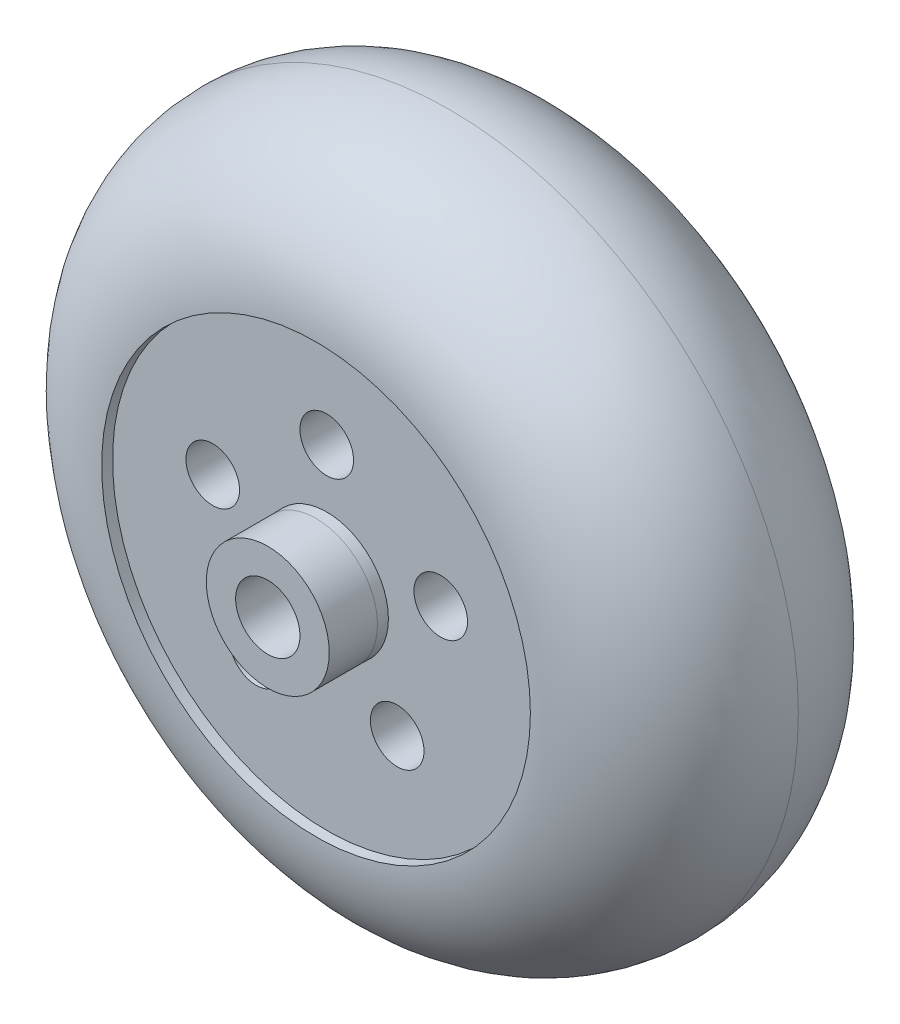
ISO-10303-21;
HEADER;
FILE_DESCRIPTION(('STEP AP214'),'2;1');
FILE_NAME('part.step','',(''),(''),'','','');
FILE_SCHEMA(('AUTOMOTIVE_DESIGN { 1 0 10303 214 1 1 1 1 }'));
ENDSEC;
DATA;
#1=APPLICATION_CONTEXT('core data for automotive mechanical design processes');
#2=APPLICATION_PROTOCOL_DEFINITION('international standard','automotive_design',2000,#1);
#3=PRODUCT_CONTEXT('',#1,'mechanical');
#4=PRODUCT('Part','Part','',(#3));
#5=PRODUCT_RELATED_PRODUCT_CATEGORY('part','',(#4));
#6=PRODUCT_DEFINITION_FORMATION('','',#4);
#7=PRODUCT_DEFINITION_CONTEXT('part definition',#1,'design');
#8=PRODUCT_DEFINITION('design','',#6,#7);
#9=PRODUCT_DEFINITION_SHAPE('','',#8);
#10=(LENGTH_UNIT() NAMED_UNIT(*) SI_UNIT(.MILLI.,.METRE.));
#11=(NAMED_UNIT(*) PLANE_ANGLE_UNIT() SI_UNIT($,.RADIAN.));
#12=(NAMED_UNIT(*) SI_UNIT($,.STERADIAN.) SOLID_ANGLE_UNIT());
#13=UNCERTAINTY_MEASURE_WITH_UNIT(LENGTH_MEASURE(1.E-05),#10,'distance_accuracy_value','');
#14=(GEOMETRIC_REPRESENTATION_CONTEXT(3) GLOBAL_UNCERTAINTY_ASSIGNED_CONTEXT((#13)) GLOBAL_UNIT_ASSIGNED_CONTEXT((#10,
#11,#12)) REPRESENTATION_CONTEXT('',''));
#15=CARTESIAN_POINT('',(0.,0.,0.));
#16=DIRECTION('',(0.,0.,1.));
#17=DIRECTION('',(1.,0.,0.));
#18=AXIS2_PLACEMENT_3D('',#15,#16,#17);
#19=CARTESIAN_POINT('',(0.,11.1823834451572,0.));
#20=DIRECTION('',(0.,0.,1.));
#21=DIRECTION('',(1.,0.,0.));
#22=AXIS2_PLACEMENT_3D('',#19,#20,#21);
#23=CYLINDRICAL_SURFACE('',#22,2.5);
#24=CARTESIAN_POINT('',(0.,11.1823834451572,24.));
#25=DIRECTION('',(0.,0.,1.));
#26=DIRECTION('',(1.,0.,0.));
#27=AXIS2_PLACEMENT_3D('',#24,#25,#26);
#28=CIRCLE('',#27,2.5);
#29=CARTESIAN_POINT('',(2.5,11.1823834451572,24.));
#30=VERTEX_POINT('',#29);
#31=EDGE_CURVE('E57',#30,#30,#28,.T.);
#32=ORIENTED_EDGE('',*,*,#31,.T.);
#33=EDGE_LOOP('',(#32));
#34=FACE_BOUND('',#33,.T.);
#35=CARTESIAN_POINT('',(0.,11.1823834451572,1.));
#36=DIRECTION('',(0.,0.,-1.));
#37=DIRECTION('',(-1.,0.,0.));
#38=AXIS2_PLACEMENT_3D('',#35,#36,#37);
#39=CIRCLE('',#38,2.5);
#40=CARTESIAN_POINT('',(-2.5,11.1823834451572,1.));
#41=VERTEX_POINT('',#40);
#42=EDGE_CURVE('E72',#41,#41,#39,.F.);
#43=ORIENTED_EDGE('',*,*,#42,.F.);
#44=EDGE_LOOP('',(#43));
#45=FACE_BOUND('',#44,.T.);
#46=ADVANCED_FACE('F34',(#34,#45),#23,.F.);
#47=CARTESIAN_POINT('',(10.6350786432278,3.45554652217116,0.));
#48=DIRECTION('',(0.,0.,1.));
#49=DIRECTION('',(1.,0.,0.));
#50=AXIS2_PLACEMENT_3D('',#47,#48,#49);
#51=CYLINDRICAL_SURFACE('',#50,2.50000000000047);
#52=CARTESIAN_POINT('',(10.6350786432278,3.45554652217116,24.));
#53=DIRECTION('',(0.,0.,1.));
#54=DIRECTION('',(1.,0.,0.));
#55=AXIS2_PLACEMENT_3D('',#52,#53,#54);
#56=CIRCLE('',#55,2.50000000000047);
#57=CARTESIAN_POINT('',(13.1350786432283,3.45554652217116,24.));
#58=VERTEX_POINT('',#57);
#59=EDGE_CURVE('E60',#58,#58,#56,.T.);
#60=ORIENTED_EDGE('',*,*,#59,.T.);
#61=EDGE_LOOP('',(#60));
#62=FACE_BOUND('',#61,.T.);
#63=CARTESIAN_POINT('',(10.6350786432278,3.45554652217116,1.));
#64=DIRECTION('',(0.,0.,-1.));
#65=DIRECTION('',(-1.,0.,0.));
#66=AXIS2_PLACEMENT_3D('',#63,#64,#65);
#67=CIRCLE('',#66,2.50000000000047);
#68=CARTESIAN_POINT('',(8.13507864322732,3.45554652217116,1.));
#69=VERTEX_POINT('',#68);
#70=EDGE_CURVE('E75',#69,#69,#67,.F.);
#71=ORIENTED_EDGE('',*,*,#70,.F.);
#72=EDGE_LOOP('',(#71));
#73=FACE_BOUND('',#72,.T.);
#74=ADVANCED_FACE('F121',(#62,#73),#51,.F.);
#75=CARTESIAN_POINT('',(6.57284007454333,-9.04673824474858,0.));
#76=DIRECTION('',(0.,0.,1.));
#77=DIRECTION('',(1.,0.,0.));
#78=AXIS2_PLACEMENT_3D('',#75,#76,#77);
#79=CYLINDRICAL_SURFACE('',#78,2.50000000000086);
#80=CARTESIAN_POINT('',(6.57284007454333,-9.04673824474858,24.));
#81=DIRECTION('',(0.,0.,1.));
#82=DIRECTION('',(1.,0.,0.));
#83=AXIS2_PLACEMENT_3D('',#80,#81,#82);
#84=CIRCLE('',#83,2.50000000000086);
#85=CARTESIAN_POINT('',(9.07284007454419,-9.04673824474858,24.));
#86=VERTEX_POINT('',#85);
#87=EDGE_CURVE('E63',#86,#86,#84,.T.);
#88=ORIENTED_EDGE('',*,*,#87,.T.);
#89=EDGE_LOOP('',(#88));
#90=FACE_BOUND('',#89,.T.);
#91=CARTESIAN_POINT('',(6.57284007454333,-9.04673824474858,1.));
#92=DIRECTION('',(0.,0.,-1.));
#93=DIRECTION('',(-1.,0.,0.));
#94=AXIS2_PLACEMENT_3D('',#91,#92,#93);
#95=CIRCLE('',#94,2.50000000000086);
#96=CARTESIAN_POINT('',(4.07284007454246,-9.04673824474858,1.));
#97=VERTEX_POINT('',#96);
#98=EDGE_CURVE('E78',#97,#97,#95,.F.);
#99=ORIENTED_EDGE('',*,*,#98,.F.);
#100=EDGE_LOOP('',(#99));
#101=FACE_BOUND('',#100,.T.);
#102=ADVANCED_FACE('F127',(#90,#101),#79,.F.);
#103=CARTESIAN_POINT('',(-6.57284007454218,-9.04673824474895,0.));
#104=DIRECTION('',(0.,0.,1.));
#105=DIRECTION('',(1.,0.,0.));
#106=AXIS2_PLACEMENT_3D('',#103,#104,#105);
#107=CYLINDRICAL_SURFACE('',#106,2.50000000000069);
#108=CARTESIAN_POINT('',(-6.57284007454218,-9.04673824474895,24.));
#109=DIRECTION('',(0.,0.,1.));
#110=DIRECTION('',(1.,0.,0.));
#111=AXIS2_PLACEMENT_3D('',#108,#109,#110);
#112=CIRCLE('',#111,2.50000000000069);
#113=CARTESIAN_POINT('',(-4.0728400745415,-9.04673824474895,24.));
#114=VERTEX_POINT('',#113);
#115=EDGE_CURVE('E66',#114,#114,#112,.T.);
#116=ORIENTED_EDGE('',*,*,#115,.T.);
#117=EDGE_LOOP('',(#116));
#118=FACE_BOUND('',#117,.T.);
#119=CARTESIAN_POINT('',(-6.57284007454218,-9.04673824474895,1.));
#120=DIRECTION('',(0.,0.,-1.));
#121=DIRECTION('',(-1.,0.,0.));
#122=AXIS2_PLACEMENT_3D('',#119,#120,#121);
#123=CIRCLE('',#122,2.50000000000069);
#124=CARTESIAN_POINT('',(-9.07284007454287,-9.04673824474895,1.));
#125=VERTEX_POINT('',#124);
#126=EDGE_CURVE('E81',#125,#125,#123,.F.);
#127=ORIENTED_EDGE('',*,*,#126,.F.);
#128=EDGE_LOOP('',(#127));
#129=FACE_BOUND('',#128,.T.);
#130=ADVANCED_FACE('F157',(#118,#129),#107,.F.);
#131=CARTESIAN_POINT('',(-10.6350786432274,3.45554652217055,0.));
#132=DIRECTION('',(0.,0.,1.));
#133=DIRECTION('',(1.,0.,0.));
#134=AXIS2_PLACEMENT_3D('',#131,#132,#133);
#135=CYLINDRICAL_SURFACE('',#134,2.50000000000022);
#136=CARTESIAN_POINT('',(-10.6350786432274,3.45554652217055,24.));
#137=DIRECTION('',(0.,0.,1.));
#138=DIRECTION('',(1.,0.,0.));
#139=AXIS2_PLACEMENT_3D('',#136,#137,#138);
#140=CIRCLE('',#139,2.50000000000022);
#141=CARTESIAN_POINT('',(-8.13507864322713,3.45554652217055,24.));
#142=VERTEX_POINT('',#141);
#143=EDGE_CURVE('E69',#142,#142,#140,.T.);
#144=ORIENTED_EDGE('',*,*,#143,.T.);
#145=EDGE_LOOP('',(#144));
#146=FACE_BOUND('',#145,.T.);
#147=CARTESIAN_POINT('',(-10.6350786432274,3.45554652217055,1.));
#148=DIRECTION('',(0.,0.,-1.));
#149=DIRECTION('',(-1.,0.,0.));
#150=AXIS2_PLACEMENT_3D('',#147,#148,#149);
#151=CIRCLE('',#150,2.50000000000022);
#152=CARTESIAN_POINT('',(-13.1350786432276,3.45554652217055,1.));
#153=VERTEX_POINT('',#152);
#154=EDGE_CURVE('E38',#153,#153,#151,.F.);
#155=ORIENTED_EDGE('',*,*,#154,.F.);
#156=EDGE_LOOP('',(#155));
#157=FACE_BOUND('',#156,.T.);
#158=ADVANCED_FACE('F150',(#146,#157),#135,.F.);
#159=CARTESIAN_POINT('',(0.,0.,12.5));
#160=DIRECTION('',(0.,0.,1.));
#161=DIRECTION('',(1.,0.,0.));
#162=AXIS2_PLACEMENT_3D('',#159,#160,#161);
#163=TOROIDAL_SURFACE('',#162,20.,12.5);
#164=CARTESIAN_POINT('',(0.,0.,12.5));
#165=DIRECTION('',(0.,0.,1.));
#166=DIRECTION('',(1.,0.,0.));
#167=AXIS2_PLACEMENT_3D('',#164,#165,#166);
#168=CIRCLE('',#167,32.5);
#169=CARTESIAN_POINT('',(32.5,0.,12.5));
#170=VERTEX_POINT('',#169);
#171=EDGE_CURVE('E10',#170,#170,#168,.F.);
#172=ORIENTED_EDGE('',*,*,#171,.F.);
#173=EDGE_LOOP('',(#172));
#174=FACE_BOUND('',#173,.T.);
#175=CARTESIAN_POINT('',(0.,0.,25.));
#176=DIRECTION('',(0.,0.,1.));
#177=DIRECTION('',(1.,0.,0.));
#178=AXIS2_PLACEMENT_3D('',#175,#176,#177);
#179=CIRCLE('',#178,20.);
#180=CARTESIAN_POINT('',(20.,0.,25.));
#181=VERTEX_POINT('',#180);
#182=EDGE_CURVE('E46',#181,#181,#179,.T.);
#183=ORIENTED_EDGE('',*,*,#182,.F.);
#184=EDGE_LOOP('',(#183));
#185=FACE_BOUND('',#184,.T.);
#186=ADVANCED_FACE('F148',(#174,#185),#163,.T.);
#187=CARTESIAN_POINT('',(0.,0.,12.5));
#188=DIRECTION('',(0.,0.,1.));
#189=DIRECTION('',(1.,0.,0.));
#190=AXIS2_PLACEMENT_3D('',#187,#188,#189);
#191=TOROIDAL_SURFACE('',#190,20.,12.5);
#192=CARTESIAN_POINT('',(0.,0.,0.));
#193=DIRECTION('',(0.,0.,-1.));
#194=DIRECTION('',(-1.,0.,0.));
#195=AXIS2_PLACEMENT_3D('',#192,#193,#194);
#196=CIRCLE('',#195,20.);
#197=CARTESIAN_POINT('',(-20.,0.,0.));
#198=VERTEX_POINT('',#197);
#199=EDGE_CURVE('E84',#198,#198,#196,.T.);
#200=ORIENTED_EDGE('',*,*,#199,.F.);
#201=EDGE_LOOP('',(#200));
#202=FACE_BOUND('',#201,.T.);
#203=ORIENTED_EDGE('',*,*,#171,.T.);
#204=EDGE_LOOP('',(#203));
#205=FACE_BOUND('',#204,.T.);
#206=ADVANCED_FACE('F36',(#202,#205),#191,.T.);
#207=CARTESIAN_POINT('',(0.,0.,0.));
#208=DIRECTION('',(0.,0.,1.));
#209=DIRECTION('',(1.,0.,0.));
#210=AXIS2_PLACEMENT_3D('',#207,#208,#209);
#211=CYLINDRICAL_SURFACE('',#210,3.);
#212=CARTESIAN_POINT('',(0.,0.,29.5));
#213=DIRECTION('',(0.,0.,1.));
#214=DIRECTION('',(1.,0.,0.));
#215=AXIS2_PLACEMENT_3D('',#212,#213,#214);
#216=CIRCLE('',#215,3.);
#217=CARTESIAN_POINT('',(3.,0.,29.5));
#218=VERTEX_POINT('',#217);
#219=EDGE_CURVE('E96',#218,#218,#216,.T.);
#220=ORIENTED_EDGE('',*,*,#219,.T.);
#221=EDGE_LOOP('',(#220));
#222=FACE_BOUND('',#221,.T.);
#223=CARTESIAN_POINT('',(0.,0.,-4.5));
#224=DIRECTION('',(0.,0.,-1.));
#225=DIRECTION('',(-1.,0.,0.));
#226=AXIS2_PLACEMENT_3D('',#223,#224,#225);
#227=CIRCLE('',#226,3.);
#228=CARTESIAN_POINT('',(-3.,0.,-4.5));
#229=VERTEX_POINT('',#228);
#230=EDGE_CURVE('E102',#229,#229,#227,.T.);
#231=ORIENTED_EDGE('',*,*,#230,.T.);
#232=EDGE_LOOP('',(#231));
#233=FACE_BOUND('',#232,.T.);
#234=ADVANCED_FACE('F106',(#222,#233),#211,.F.);
#235=CARTESIAN_POINT('',(0.,0.,25.));
#236=DIRECTION('',(0.,0.,1.));
#237=DIRECTION('',(1.,0.,0.));
#238=AXIS2_PLACEMENT_3D('',#235,#236,#237);
#239=CONICAL_SURFACE('',#238,20.,0.0174532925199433);
#240=CARTESIAN_POINT('',(0.,0.,24.));
#241=DIRECTION('',(0.,0.,1.));
#242=DIRECTION('',(1.,0.,0.));
#243=AXIS2_PLACEMENT_3D('',#240,#241,#242);
#244=CIRCLE('',#243,19.9825449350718);
#245=CARTESIAN_POINT('',(19.9825449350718,0.,24.));
#246=VERTEX_POINT('',#245);
#247=EDGE_CURVE('E42',#246,#246,#244,.T.);
#248=ORIENTED_EDGE('',*,*,#247,.F.);
#249=EDGE_LOOP('',(#248));
#250=FACE_BOUND('',#249,.T.);
#251=ORIENTED_EDGE('',*,*,#182,.T.);
#252=EDGE_LOOP('',(#251));
#253=FACE_BOUND('',#252,.T.);
#254=ADVANCED_FACE('F137',(#250,#253),#239,.F.);
#255=CARTESIAN_POINT('',(0.,0.,24.));
#256=DIRECTION('',(0.,0.,1.));
#257=DIRECTION('',(1.,0.,0.));
#258=AXIS2_PLACEMENT_3D('',#255,#256,#257);
#259=PLANE('',#258);
#260=ORIENTED_EDGE('',*,*,#143,.F.);
#261=EDGE_LOOP('',(#260));
#262=FACE_BOUND('',#261,.T.);
#263=ORIENTED_EDGE('',*,*,#115,.F.);
#264=EDGE_LOOP('',(#263));
#265=FACE_BOUND('',#264,.T.);
#266=ORIENTED_EDGE('',*,*,#87,.F.);
#267=EDGE_LOOP('',(#266));
#268=FACE_BOUND('',#267,.T.);
#269=ORIENTED_EDGE('',*,*,#59,.F.);
#270=EDGE_LOOP('',(#269));
#271=FACE_BOUND('',#270,.T.);
#272=ORIENTED_EDGE('',*,*,#31,.F.);
#273=EDGE_LOOP('',(#272));
#274=FACE_BOUND('',#273,.T.);
#275=CARTESIAN_POINT('',(0.,0.,24.));
#276=DIRECTION('',(0.,0.,1.));
#277=DIRECTION('',(1.,0.,0.));
#278=AXIS2_PLACEMENT_3D('',#275,#276,#277);
#279=CIRCLE('',#278,5.75259580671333);
#280=CARTESIAN_POINT('',(5.75259580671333,0.,24.));
#281=VERTEX_POINT('',#280);
#282=EDGE_CURVE('E49',#281,#281,#279,.T.);
#283=ORIENTED_EDGE('',*,*,#282,.F.);
#284=EDGE_LOOP('',(#283));
#285=FACE_BOUND('',#284,.T.);
#286=ORIENTED_EDGE('',*,*,#247,.T.);
#287=EDGE_LOOP('',(#286));
#288=FACE_BOUND('',#287,.T.);
#289=ADVANCED_FACE('F133',(#262,#265,#268,#271,#274,#285,#288),#259,.T.);
#290=CARTESIAN_POINT('',(0.,0.,25.));
#291=DIRECTION('',(0.,0.,-1.));
#292=DIRECTION('',(1.,0.,0.));
#293=AXIS2_PLACEMENT_3D('',#290,#291,#292);
#294=CONICAL_SURFACE('',#293,5.73514074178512,0.0174532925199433);
#295=ORIENTED_EDGE('',*,*,#282,.T.);
#296=EDGE_LOOP('',(#295));
#297=FACE_BOUND('',#296,.T.);
#298=CARTESIAN_POINT('',(0.,0.,25.));
#299=DIRECTION('',(0.,0.,1.));
#300=DIRECTION('',(1.,0.,0.));
#301=AXIS2_PLACEMENT_3D('',#298,#299,#300);
#302=CIRCLE('',#301,5.73514074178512);
#303=CARTESIAN_POINT('',(5.73514074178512,0.,25.));
#304=VERTEX_POINT('',#303);
#305=EDGE_CURVE('E52',#304,#304,#302,.T.);
#306=ORIENTED_EDGE('',*,*,#305,.F.);
#307=EDGE_LOOP('',(#306));
#308=FACE_BOUND('',#307,.T.);
#309=ADVANCED_FACE('F136',(#297,#308),#294,.T.);
#310=CARTESIAN_POINT('',(0.,0.,1.));
#311=DIRECTION('',(0.,0.,-1.));
#312=DIRECTION('',(-1.,0.,0.));
#313=AXIS2_PLACEMENT_3D('',#310,#311,#312);
#314=PLANE('',#313);
#315=CARTESIAN_POINT('',(0.,0.,1.));
#316=DIRECTION('',(0.,0.,-1.));
#317=DIRECTION('',(-1.,0.,0.));
#318=AXIS2_PLACEMENT_3D('',#315,#316,#317);
#319=CIRCLE('',#318,6.);
#320=CARTESIAN_POINT('',(-6.,0.,1.));
#321=VERTEX_POINT('',#320);
#322=EDGE_CURVE('E88',#321,#321,#319,.T.);
#323=ORIENTED_EDGE('',*,*,#322,.F.);
#324=EDGE_LOOP('',(#323));
#325=FACE_BOUND('',#324,.T.);
#326=CARTESIAN_POINT('',(0.,0.,1.));
#327=DIRECTION('',(0.,0.,-1.));
#328=DIRECTION('',(-1.,0.,0.));
#329=AXIS2_PLACEMENT_3D('',#326,#327,#328);
#330=CIRCLE('',#329,20.);
#331=CARTESIAN_POINT('',(-20.,0.,1.));
#332=VERTEX_POINT('',#331);
#333=EDGE_CURVE('E87',#332,#332,#330,.T.);
#334=ORIENTED_EDGE('',*,*,#333,.T.);
#335=EDGE_LOOP('',(#334));
#336=FACE_BOUND('',#335,.T.);
#337=ORIENTED_EDGE('',*,*,#154,.T.);
#338=EDGE_LOOP('',(#337));
#339=FACE_BOUND('',#338,.T.);
#340=ORIENTED_EDGE('',*,*,#126,.T.);
#341=EDGE_LOOP('',(#340));
#342=FACE_BOUND('',#341,.T.);
#343=ORIENTED_EDGE('',*,*,#98,.T.);
#344=EDGE_LOOP('',(#343));
#345=FACE_BOUND('',#344,.T.);
#346=ORIENTED_EDGE('',*,*,#70,.T.);
#347=EDGE_LOOP('',(#346));
#348=FACE_BOUND('',#347,.T.);
#349=ORIENTED_EDGE('',*,*,#42,.T.);
#350=EDGE_LOOP('',(#349));
#351=FACE_BOUND('',#350,.T.);
#352=ADVANCED_FACE('F141',(#325,#336,#339,#342,#345,#348,#351),#314,.T.);
#353=CARTESIAN_POINT('',(0.,0.,1.));
#354=DIRECTION('',(0.,0.,-1.));
#355=DIRECTION('',(-1.,0.,0.));
#356=AXIS2_PLACEMENT_3D('',#353,#354,#355);
#357=CYLINDRICAL_SURFACE('',#356,20.);
#358=ORIENTED_EDGE('',*,*,#333,.F.);
#359=EDGE_LOOP('',(#358));
#360=FACE_BOUND('',#359,.T.);
#361=ORIENTED_EDGE('',*,*,#199,.T.);
#362=EDGE_LOOP('',(#361));
#363=FACE_BOUND('',#362,.T.);
#364=ADVANCED_FACE('F170',(#360,#363),#357,.F.);
#365=CARTESIAN_POINT('',(0.,0.,1.));
#366=DIRECTION('',(0.,0.,-1.));
#367=DIRECTION('',(-1.,0.,0.));
#368=AXIS2_PLACEMENT_3D('',#365,#366,#367);
#369=CYLINDRICAL_SURFACE('',#368,6.);
#370=ORIENTED_EDGE('',*,*,#322,.T.);
#371=EDGE_LOOP('',(#370));
#372=FACE_BOUND('',#371,.T.);
#373=CARTESIAN_POINT('',(0.,0.,-4.5));
#374=DIRECTION('',(0.,0.,-1.));
#375=DIRECTION('',(-1.,0.,0.));
#376=AXIS2_PLACEMENT_3D('',#373,#374,#375);
#377=CIRCLE('',#376,6.);
#378=CARTESIAN_POINT('',(-6.,0.,-4.5));
#379=VERTEX_POINT('',#378);
#380=EDGE_CURVE('E99',#379,#379,#377,.T.);
#381=ORIENTED_EDGE('',*,*,#380,.F.);
#382=EDGE_LOOP('',(#381));
#383=FACE_BOUND('',#382,.T.);
#384=ADVANCED_FACE('F190',(#372,#383),#369,.T.);
#385=CARTESIAN_POINT('',(0.,0.,29.5));
#386=DIRECTION('',(0.,0.,1.));
#387=DIRECTION('',(1.,0.,0.));
#388=AXIS2_PLACEMENT_3D('',#385,#386,#387);
#389=PLANE('',#388);
#390=CARTESIAN_POINT('',(0.,0.,29.5));
#391=DIRECTION('',(0.,0.,1.));
#392=DIRECTION('',(1.,0.,0.));
#393=AXIS2_PLACEMENT_3D('',#390,#391,#392);
#394=CIRCLE('',#393,5.73514074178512);
#395=CARTESIAN_POINT('',(5.73514074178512,0.,29.5));
#396=VERTEX_POINT('',#395);
#397=EDGE_CURVE('E93',#396,#396,#394,.T.);
#398=ORIENTED_EDGE('',*,*,#397,.T.);
#399=EDGE_LOOP('',(#398));
#400=FACE_BOUND('',#399,.T.);
#401=ORIENTED_EDGE('',*,*,#219,.F.);
#402=EDGE_LOOP('',(#401));
#403=FACE_BOUND('',#402,.T.);
#404=ADVANCED_FACE('F116',(#400,#403),#389,.T.);
#405=CARTESIAN_POINT('',(0.,0.,29.5));
#406=DIRECTION('',(0.,0.,-1.));
#407=DIRECTION('',(-1.,0.,0.));
#408=AXIS2_PLACEMENT_3D('',#405,#406,#407);
#409=CYLINDRICAL_SURFACE('',#408,5.73514074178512);
#410=ORIENTED_EDGE('',*,*,#397,.F.);
#411=EDGE_LOOP('',(#410));
#412=FACE_BOUND('',#411,.T.);
#413=ORIENTED_EDGE('',*,*,#305,.T.);
#414=EDGE_LOOP('',(#413));
#415=FACE_BOUND('',#414,.T.);
#416=ADVANCED_FACE('F110',(#412,#415),#409,.T.);
#417=CARTESIAN_POINT('',(0.,0.,-4.5));
#418=DIRECTION('',(0.,0.,-1.));
#419=DIRECTION('',(-1.,0.,0.));
#420=AXIS2_PLACEMENT_3D('',#417,#418,#419);
#421=PLANE('',#420);
#422=ORIENTED_EDGE('',*,*,#380,.T.);
#423=EDGE_LOOP('',(#422));
#424=FACE_BOUND('',#423,.T.);
#425=ORIENTED_EDGE('',*,*,#230,.F.);
#426=EDGE_LOOP('',(#425));
#427=FACE_BOUND('',#426,.T.);
#428=ADVANCED_FACE('F108',(#424,#427),#421,.T.);
#429=CLOSED_SHELL('',(#46,#74,#102,#130,#158,#186,#206,#234,#254,#289,#309,#352,#364,#384,#404,
#416,#428));
#430=MANIFOLD_SOLID_BREP('B2',#429);
#431=ADVANCED_BREP_SHAPE_REPRESENTATION('',(#18,#430),#14);
#432=SHAPE_DEFINITION_REPRESENTATION(#9,#431);
ENDSEC;
END-ISO-10303-21;
